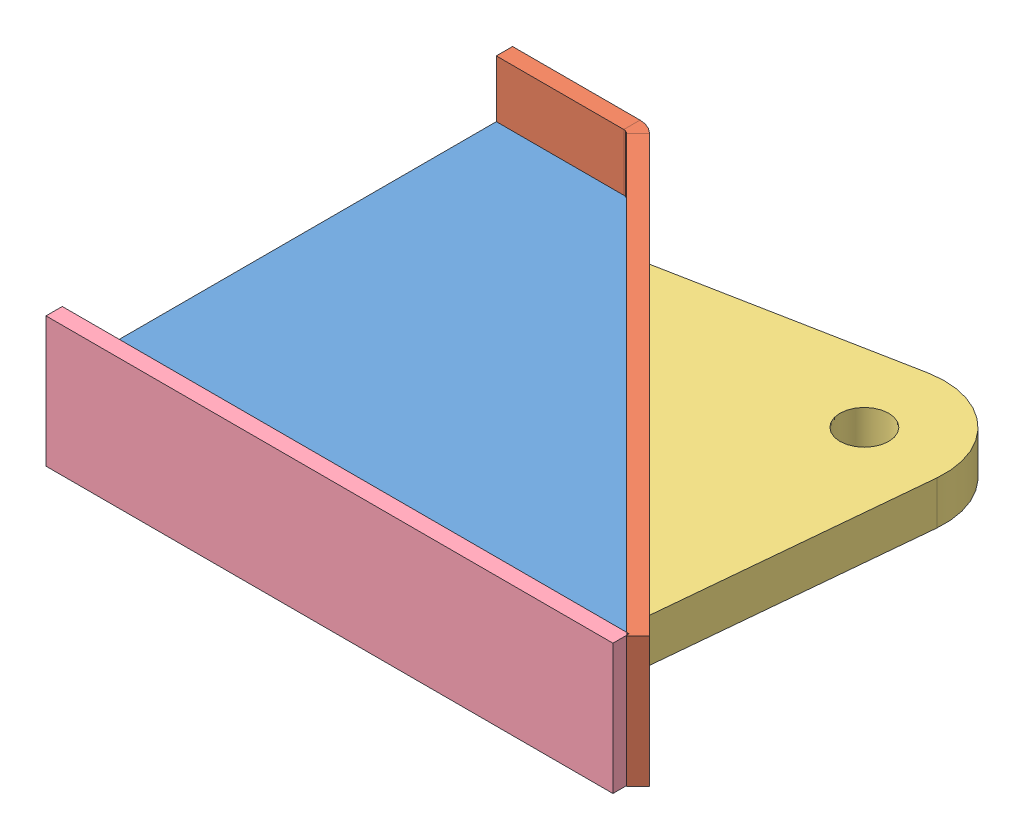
SolidWorks assembly SUSPENSION BRACKET.SLDASM, configuration Default (file format 7000). Lengths in mm.
Overall size (399.09 76.2 324.31).
4 component instances, 4 part files, 9 mates.
Components (placement in the parent):
- GUSSET BRACKET-1: GUSSET BRACKET.SLDPRT [Default] at (23.7358 -55.413 25.1217) size (330.2 9.53 254)
- MOUNT CAP PLATE-1: MOUNT CAP PLATE.SLDPRT [Default] at (-230.2642 -88.7505 -228.8783) size (338.87 76.2 265.46)
- TEARDROP-1: TEARDROP.SLDPRT [Default] at (-35.9047 -63.3505 -173.7128) x (0.707107 0 -0.707107) z (0.707107 0 0.707107) size (135.97 25.4 251.63)
- FB3-8X3X13_1-16-1: FB3-8X3X13_1-16.SLDPRT [Default] at (-140.5704 -50.6505 34.6467) x (0 -1 0) z (1 0 0) size (76.2 9.53 331.79)
Mates (geometry in assembly coordinates):
- Coincident1: coincident anti-aligned: plane of GUSSET BRACKET-1 through (-230.2642 -45.888 -228.8783) normal (0 0 -1); plane of MOUNT CAP PLATE-1 through (-230.2642 -12.5505 -228.8783) normal (0 0 1)
- Width1: width anti-aligned: plane of MOUNT CAP PLATE-1 through (-222.413 -12.5505 -234.4976) normal (0 1 0); plane of MOUNT CAP PLATE-1 through (-231.8423 -88.7505 -225.0683) normal (0 -1 0); plane of GUSSET BRACKET-1 through (23.7358 -55.413 25.1217) normal (0 -1 0); plane of GUSSET BRACKET-1 through (23.7358 -45.888 25.1217) normal (0 1 0)
- Coincident2: coincident aligned: plane of GUSSET BRACKET-1 through (-306.4642 -45.888 -228.8783) normal (-1 0 0); plane of MOUNT CAP PLATE-1 through (-306.4642 -12.5505 -228.8783) normal (-1 0 0)
- Coincident3: coincident anti-aligned: plane of MOUNT CAP PLATE-1 through (-223.529 -12.5505 -235.6135) normal (0.707107 0 -0.707107); plane of TEARDROP-1 through (-181.4397 -37.9505 -193.5242) normal (-0.707107 0 0.707107)
- Distance1: distance = 50.8 mm: line of TEARDROP-1 through (-3.5127 -37.9505 -15.5972) axis (0 -1 0); plane of MOUNT CAP PLATE-1 through (32.4083 -12.5505 20.3238) normal (0.707107 0 0.707107)
- Width2: width anti-aligned: plane of TEARDROP-1 through (-35.9047 -37.9505 -173.7128) normal (0 1 0); plane of TEARDROP-1 through (-35.9047 -63.3505 -173.7128) normal (0 -1 0); plane of MOUNT CAP PLATE-1 through (-231.8423 -88.7505 -238.4033) normal (0 -1 0); plane of MOUNT CAP PLATE-1 through (-231.8423 -12.5505 -225.0683) normal (0 1 0)
- Coincident5: coincident anti-aligned: plane of GUSSET BRACKET-1 through (-306.4642 -45.888 25.1217) normal (0 0 1); plane of FB3-8X3X13_1-16-1 through (-140.5704 -50.6505 25.1217) normal (0 0 -1)
- Coincident6: coincident aligned: plane of GUSSET BRACKET-1 through (-306.4642 -45.888 -228.8783) normal (-1 0 0); plane of FB3-8X3X13_1-16-1 through (-306.4642 -12.5505 25.1217) normal (-1 0 0)
- Width3: width aligned: plane of FB3-8X3X13_1-16-1 through (-306.4642 -12.5505 25.1217) normal (0 1 0); plane of FB3-8X3X13_1-16-1 through (-306.4642 -88.7505 25.1217) normal (0 -1 0); plane of GUSSET BRACKET-1 through (23.7358 -45.888 25.1217) normal (0 1 0); plane of GUSSET BRACKET-1 through (23.7358 -55.413 25.1217) normal (0 -1 0)
